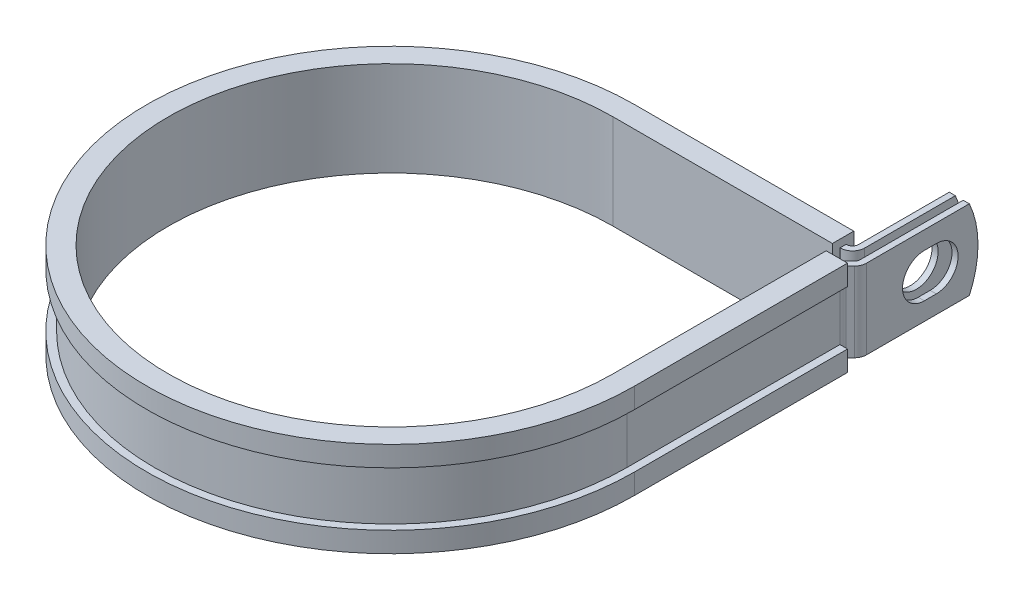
from build123d import *

# Parameters (mm, degrees)
EXTRUDE_THIN1_DEPTH = 7.9375
SKETCH2_R           = 4.3561
CUT_EXTRUDE1_DEPTH  = 1.2192
CUT_EXTRUDE2_DEPTH  = 1.2192
CUT_EXTRUDE3_DEPTH  = 116.043103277


with BuildPart() as part:
    # Sketch1 → Extrude-Thin1 (new, symmetric)
    with BuildSketch(Plane(origin=(0, 0, 0), x_dir=(1, 0, 0), z_dir=(0, 1, 0))):
        with BuildLine():
            Line((47.8714698, 68.2498), (47.8714698, 45.974))
            ThreePointArc((47.8714698, 45.974), (47.778663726, 45.507432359), (47.514374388, 45.111895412))
            Line((47.514374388, 45.111895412), (46.688190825, 44.285711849))
            ThreePointArc((46.688190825, 44.285711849), (46.159612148, 43.494637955), (45.974, 42.561502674))
            Line((45.974, 42.561502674), (45.974, 0))
            ThreePointArc((45.974, 0), (-32.508527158, -32.508527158), (0, 45.974))
            Line((0, 45.974), (43.8582698, 45.974))
            ThreePointArc((43.8582698, 45.974), (45.582478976, 46.688190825), (46.2966698, 48.4124))
            Line((46.2966698, 48.4124), (46.2966698, 68.2498))
            Line((46.2966698, 68.2498), (45.0774698, 68.2498))
            Line((45.0774698, 68.2498), (45.0774698, 48.4124))
            ThreePointArc((45.0774698, 48.4124), (44.720374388, 47.550295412), (43.8582698, 47.1932))
            Line((43.8582698, 47.1932), (0, 47.1932))
            ThreePointArc((0, 47.1932), (-33.370631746, -33.370631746), (47.1932, 0))
            Line((47.1932, 0), (47.1932, 42.561502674))
            ThreePointArc((47.1932, 42.561502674), (47.286006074, 43.028070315), (47.550295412, 43.423607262))
            Line((47.550295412, 43.423607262), (48.376478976, 44.249790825))
            ThreePointArc((48.376478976, 44.249790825), (48.905057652, 45.040864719), (49.0906698, 45.974))
            Line((49.0906698, 45.974), (49.0906698, 68.2498))
            Line((49.0906698, 68.2498), (47.8714698, 68.2498))
        make_face()
    extrude(amount=EXTRUDE_THIN1_DEPTH, both=True)

    # Sketch2 → Cut-Extrude1 (cut)
    with BuildSketch(Plane.ZY.offset(-45.0774698)):
        with Locations((-58.7248, 0)):
            Circle(SKETCH2_R)
    extrude(amount=-CUT_EXTRUDE1_DEPTH, mode=Mode.SUBTRACT)

    # Sketch3 → Cut-Extrude2 (cut)
    with BuildSketch(Plane(origin=(49.0906698, 0, 0), x_dir=(0, 0, -1), z_dir=(1, 0, 0))):
        with BuildLine():
            Line((57.531, 4.3561), (59.9186, 4.3561))
            ThreePointArc((59.9186, 4.3561), (64.2747, 0), (59.9186, -4.3561))
            Line((59.9186, -4.3561), (57.531, -4.3561))
            ThreePointArc((57.531, -4.3561), (53.1749, 0), (57.531, 4.3561))
        make_face()
    extrude(amount=-CUT_EXTRUDE2_DEPTH, mode=Mode.SUBTRACT)

    # Sketch4 → Cut-Extrude3 (cut, through all)
    with BuildSketch(Plane.ZY.offset(-45.0774698)):
        with BuildLine():
            Line((-66.517380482, 7.9375), (-68.2498, 7.9375))
            Line((-68.2498, 7.9375), (-68.2498, 0))
            ThreePointArc((-68.2498, 0), (-67.811656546, 4.062178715), (-66.517380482, 7.9375))
        make_face()
        with BuildLine():
            ThreePointArc((-66.517380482, -7.9375), (-67.811656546, -4.062178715), (-68.2498, 0))
            Line((-68.2498, 0), (-68.2498, -7.9375))
            Line((-68.2498, -7.9375), (-66.517380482, -7.9375))
        make_face()
    extrude(amount=-CUT_EXTRUDE3_DEPTH, mode=Mode.SUBTRACT)

    # Sweep1: sweep along a path in Sketch6
    with BuildLine(Plane(origin=(0, 7.9375, 0), x_dir=(1, 0, 0), z_dir=(0, 1, 0))) as sweep1_path:
        Line((44.45, 42.561502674), (44.45, 0))
        ThreePointArc((44.45, 0), (-31.430896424, -31.430896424), (0, 44.45))
        Line((0, 44.45), (43.8074698, 44.45))
    # Sketch5 → Sweep1 (sweep)
    with BuildSketch(Plane(origin=(0, 0, -42.561502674), x_dir=(-1, 0, 0), z_dir=(0, 0, -1))):
        Polygon((-47.1932, 7.9375), (-45.974, 7.9375), (-45.974, -7.9375), (-47.1932, -7.9375), (-47.1932, -5.3975), (-48.7172, -5.3975), (-48.7172, -9.4615), (-44.45, -9.4615), (-44.45, 9.4615), (-48.7172, 9.4615), (-48.7172, 5.3975), (-47.1932, 5.3975), align=None)
    sweep(path=sweep1_path.line)


solid = part.part
